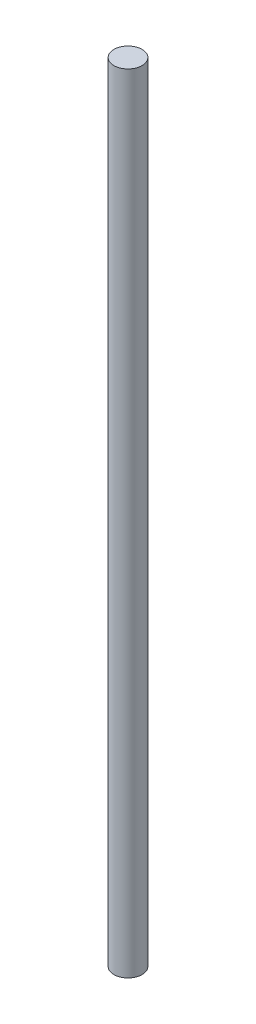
ISO-10303-21;
HEADER;
FILE_DESCRIPTION(('STEP AP214'),'2;1');
FILE_NAME('part.step','',(''),(''),'','','');
FILE_SCHEMA(('AUTOMOTIVE_DESIGN { 1 0 10303 214 1 1 1 1 }'));
ENDSEC;
DATA;
#1=APPLICATION_CONTEXT('core data for automotive mechanical design processes');
#2=APPLICATION_PROTOCOL_DEFINITION('international standard','automotive_design',2000,#1);
#3=PRODUCT_CONTEXT('',#1,'mechanical');
#4=PRODUCT('Part','Part','',(#3));
#5=PRODUCT_RELATED_PRODUCT_CATEGORY('part','',(#4));
#6=PRODUCT_DEFINITION_FORMATION('','',#4);
#7=PRODUCT_DEFINITION_CONTEXT('part definition',#1,'design');
#8=PRODUCT_DEFINITION('design','',#6,#7);
#9=PRODUCT_DEFINITION_SHAPE('','',#8);
#10=(LENGTH_UNIT() NAMED_UNIT(*) SI_UNIT(.MILLI.,.METRE.));
#11=(NAMED_UNIT(*) PLANE_ANGLE_UNIT() SI_UNIT($,.RADIAN.));
#12=(NAMED_UNIT(*) SI_UNIT($,.STERADIAN.) SOLID_ANGLE_UNIT());
#13=UNCERTAINTY_MEASURE_WITH_UNIT(LENGTH_MEASURE(1.E-05),#10,'distance_accuracy_value','');
#14=(GEOMETRIC_REPRESENTATION_CONTEXT(3) GLOBAL_UNCERTAINTY_ASSIGNED_CONTEXT((#13)) GLOBAL_UNIT_ASSIGNED_CONTEXT((#10,
#11,#12)) REPRESENTATION_CONTEXT('',''));
#15=CARTESIAN_POINT('',(0.,0.,0.));
#16=DIRECTION('',(0.,0.,1.));
#17=DIRECTION('',(1.,0.,0.));
#18=AXIS2_PLACEMENT_3D('',#15,#16,#17);
#19=CARTESIAN_POINT('',(0.,355.6,0.));
#20=DIRECTION('',(0.,-1.,0.));
#21=DIRECTION('',(0.,0.,-1.));
#22=AXIS2_PLACEMENT_3D('',#19,#20,#21);
#23=CYLINDRICAL_SURFACE('',#22,6.35);
#24=CARTESIAN_POINT('',(0.,355.6,0.));
#25=DIRECTION('',(0.,1.,0.));
#26=DIRECTION('',(0.,0.,1.));
#27=AXIS2_PLACEMENT_3D('',#24,#25,#26);
#28=CIRCLE('',#27,6.35);
#29=CARTESIAN_POINT('',(0.,355.6,6.35));
#30=VERTEX_POINT('',#29);
#31=EDGE_CURVE('E10',#30,#30,#28,.T.);
#32=ORIENTED_EDGE('',*,*,#31,.F.);
#33=EDGE_LOOP('',(#32));
#34=FACE_BOUND('',#33,.T.);
#35=CARTESIAN_POINT('',(0.,0.,0.));
#36=DIRECTION('',(0.,1.,0.));
#37=DIRECTION('',(0.,0.,1.));
#38=AXIS2_PLACEMENT_3D('',#35,#36,#37);
#39=CIRCLE('',#38,6.35);
#40=CARTESIAN_POINT('',(0.,0.,6.35));
#41=VERTEX_POINT('',#40);
#42=EDGE_CURVE('E34',#41,#41,#39,.T.);
#43=ORIENTED_EDGE('',*,*,#42,.T.);
#44=EDGE_LOOP('',(#43));
#45=FACE_BOUND('',#44,.T.);
#46=ADVANCED_FACE('F31',(#34,#45),#23,.T.);
#47=CARTESIAN_POINT('',(0.,355.6,0.));
#48=DIRECTION('',(0.,1.,0.));
#49=DIRECTION('',(0.,0.,1.));
#50=AXIS2_PLACEMENT_3D('',#47,#48,#49);
#51=PLANE('',#50);
#52=ORIENTED_EDGE('',*,*,#31,.T.);
#53=EDGE_LOOP('',(#52));
#54=FACE_BOUND('',#53,.T.);
#55=ADVANCED_FACE('F46',(#54),#51,.T.);
#56=CARTESIAN_POINT('',(0.,0.,0.));
#57=DIRECTION('',(0.,1.,0.));
#58=DIRECTION('',(0.,0.,1.));
#59=AXIS2_PLACEMENT_3D('',#56,#57,#58);
#60=PLANE('',#59);
#61=ORIENTED_EDGE('',*,*,#42,.F.);
#62=EDGE_LOOP('',(#61));
#63=FACE_BOUND('',#62,.T.);
#64=ADVANCED_FACE('F44',(#63),#60,.F.);
#65=CLOSED_SHELL('',(#46,#55,#64));
#66=MANIFOLD_SOLID_BREP('B2',#65);
#67=ADVANCED_BREP_SHAPE_REPRESENTATION('',(#18,#66),#14);
#68=SHAPE_DEFINITION_REPRESENTATION(#9,#67);
ENDSEC;
END-ISO-10303-21;
